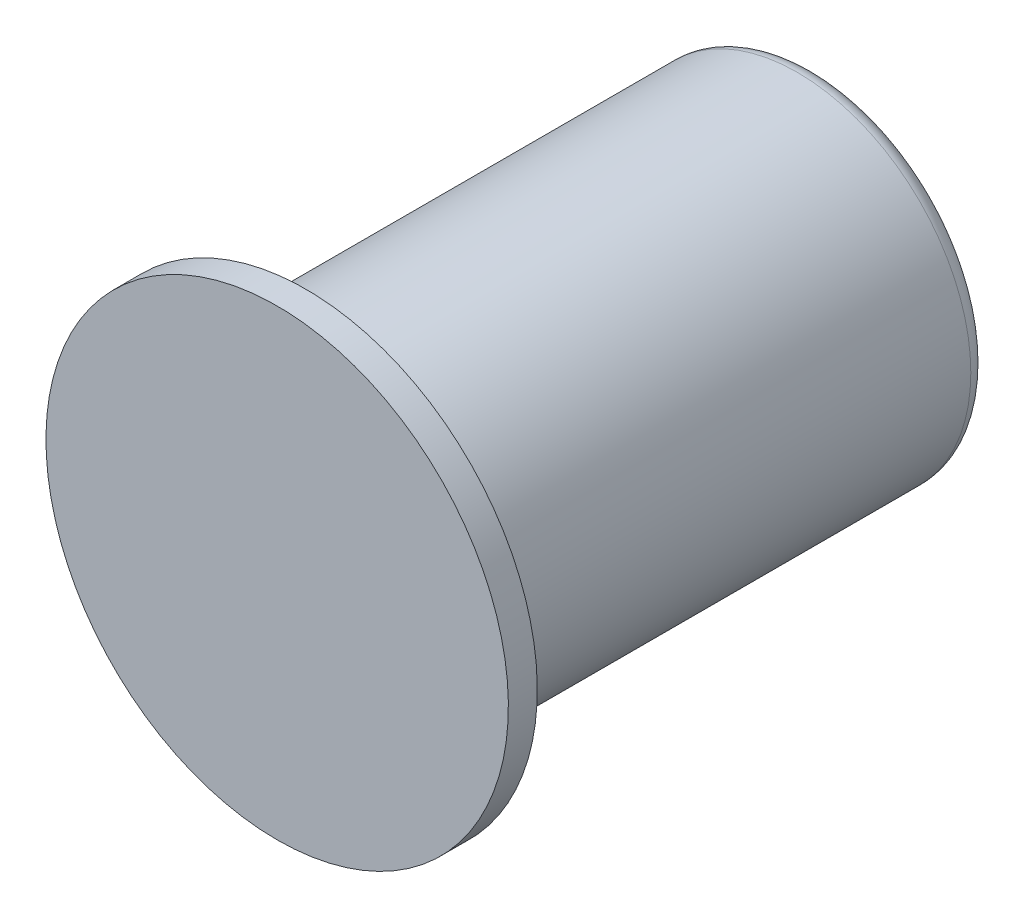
from build123d import *


with BuildPart() as part:
    # Sketch1 → Revolve1 (revolve)
    with BuildSketch(Plane(origin=(0, 0, 0), x_dir=(0, 0, -1), z_dir=(1, 0, 0)), mode=Mode.PRIVATE) as revolve1_sk:
        with BuildLine():
            Line((0, 0), (0, 40))
            Line((0, 40), (5, 40))
            Line((5, 40), (5, 30))
            Line((5, 30), (90, 30))
            ThreePointArc((90, 30), (92.121320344, 29.121320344), (93, 27))
            Line((93, 27), (93, 5.5))
            Line((93, 5.5), (92.5, 5))
            Line((92.5, 5), (84, 5))
            Line((84, 5), (81.113248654, 0))
            Line((81.113248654, 0), (0, 0))
        make_face()
    revolve(revolve1_sk.sketch.rotate(Axis((0, 0, 0), (0, 0, -1)), 180), axis=Axis((0, 0, 0), (0, 0, -1)))


solid = part.part
